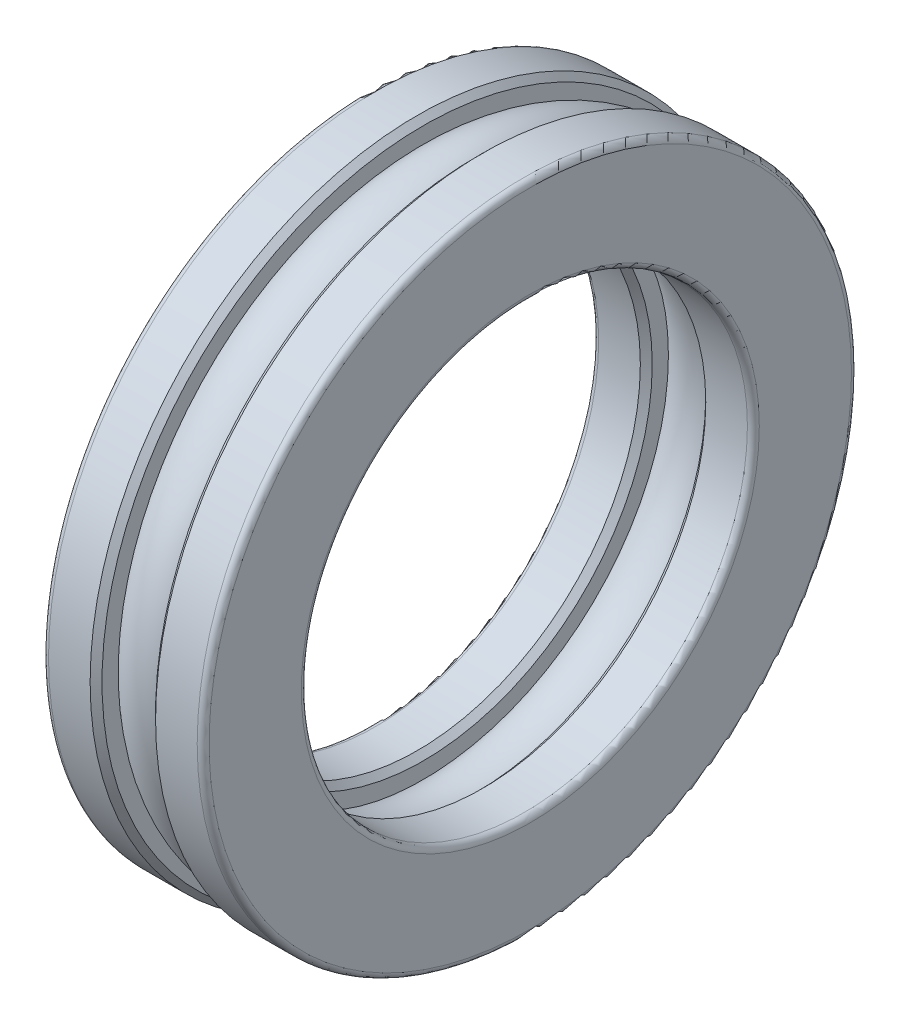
from build123d import *

# Parameters (mm, degrees)
ESQUISSE2_R = 6.75


with BuildPart() as part:
    # Esquisse1 → R_volution1 (revolve)
    with BuildSketch(Plane.XY, mode=Mode.PRIVATE) as r_volution1_sk:
        with BuildLine():
            Line((9, 38.5), (9, 41.218847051))
            ThreePointArc((9, 41.218847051), (6.75, 46.25), (9, 51.281152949))
            Line((9, 51.281152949), (9, 54))
            Line((9, 54), (8, 55))
            Line((8, 55), (1, 55))
            ThreePointArc((1, 55), (0.292893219, 54.707106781), (0, 54))
            Line((0, 54), (0, 38.5))
            ThreePointArc((0, 38.5), (0.292893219, 37.792893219), (1, 37.5))
            Line((1, 37.5), (8, 37.5))
            Line((8, 37.5), (9, 38.5))
        make_face()
    r_volution1 = revolve(r_volution1_sk.sketch.rotate(Axis((0, 0, 0), (1, 0, 0)), 270), axis=Axis((0, 0, 0), (1, 0, 0)))

    # Esquisse2 → R_volution3 (revolve)
    with BuildSketch(Plane.XY, mode=Mode.PRIVATE) as r_volution3_sk:
        with Locations((13.5, 46.25)):
            Circle(ESQUISSE2_R)
    revolve(r_volution3_sk.sketch.rotate(Axis((6.75, 0, 0), (1, 0, 0)), 90), axis=Axis((6.75, 0, 0), (1, 0, 0)))

    # Sym_trie2: R_volution1 across plane
    add(r_volution1.mirror(Plane(origin=(13.5, 0, 0), x_dir=(0, 0, 1), z_dir=(1, 0, 0))))


solid = part.part
